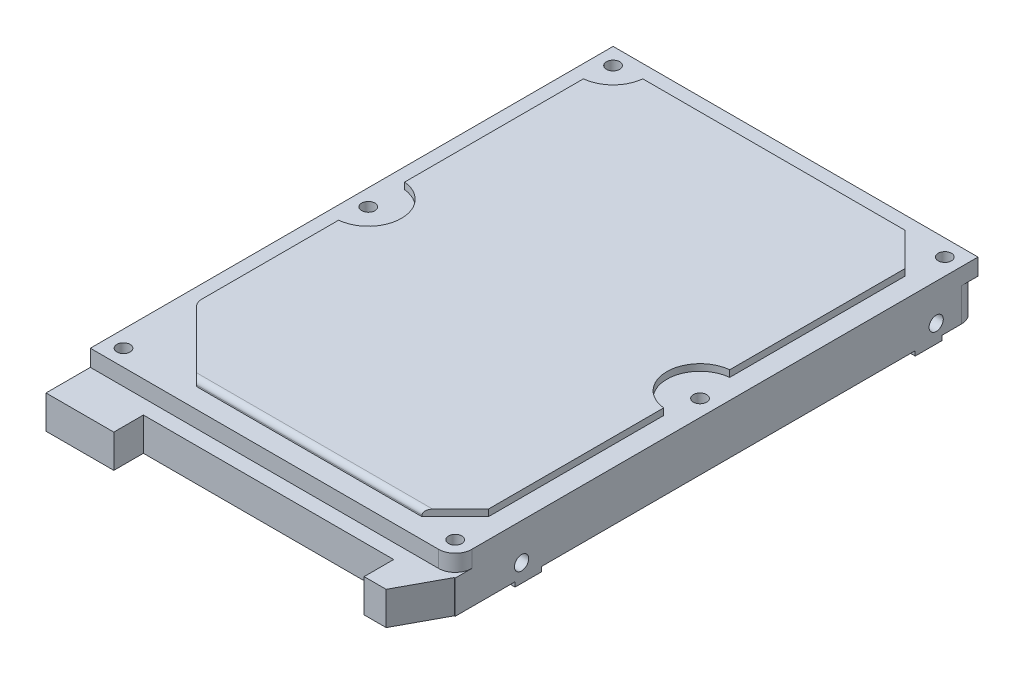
from build123d import *

# Parameters (mm, degrees)
S2D0001_W           = 69.85
S2D0001_H           = 100.076
BOSS_EXTRUDE1_DEPTH = 3.175
FILLET1_R           = 3.175
S2D0002_R           = 1.27
CUT_EXTRUDE1_DEPTH  = 3.4925
BOSS_EXTRUDE2_DEPTH = 1.27
FILLET2_R           = 2.54
FILLET3_R           = 1.016
BOSS_EXTRUDE3_DEPTH = 6.35
S2D0005_W           = 5.08
S2D0005_H           = 6.35
BOSS_EXTRUDE4_DEPTH = 69.85
BOSS_EXTRUDE5_DEPTH = 0.889
BOSS_EXTRUDE6_DEPTH = 6.35
SKETCH16_R          = 2
CUT_EXTRUDE2_DEPTH  = 2


with BuildPart() as part:
    # S2D0001 → Boss-Extrude1 (new body)
    with BuildSketch(Plane(origin=(0, 0, 0), x_dir=(1, 0, 0), z_dir=(0, 1, 0))):
        with Locations((34.925, 50.038)):
            Rectangle(S2D0001_W, S2D0001_H)
    extrude(amount=-BOSS_EXTRUDE1_DEPTH)

    # Fillet1
    fillet1_edges = [part.edges().sort_by_distance(p)[0] for p in [
        (69.85, -1.5875, 0),
    ]]
    fillet(fillet1_edges, radius=FILLET1_R)

    # S2D0002 → Cut-Extrude1 (cut)
    with BuildSketch(Plane(origin=(0, 0, 0), x_dir=(1, 0, 0), z_dir=(0, 1, 0))):
        with Locations(Location((3.175, 96.901, 0), (0, 0, 270))):
            Circle(S2D0002_R)
        with Locations(Location((66.675, 96.901, 0), (0, 0, 270))):
            Circle(S2D0002_R)
        with Locations(Location((3.175, 50.038, 0), (0, 0, 270))):
            Circle(S2D0002_R)
        with Locations(Location((66.675, 50.038, 0), (0, 0, 270))):
            Circle(S2D0002_R)
        with Locations(Location((3.175, 3.175, 0), (0, 0, 270))):
            Circle(S2D0002_R)
        with Locations(Location((66.675, 3.175, 0), (0, 0, 270))):
            Circle(S2D0002_R)
    extrude(amount=-CUT_EXTRUDE1_DEPTH, mode=Mode.SUBTRACT)

    # Sketch3 → Boss-Extrude2 (add)
    with BuildSketch(Plane(origin=(0, 0, 0), x_dir=(-1, 0, 0), z_dir=(0, 1, 0))):
        with BuildLine():
            Line((-9.493170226, -96.266), (-59.69, -96.266))
            Line((-59.69, -96.266), (-66.04, -89.916))
            Line((-66.04, -89.916), (-66.04, -56.356170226))
            ThreePointArc((-66.04, -56.356170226), (-60.325, -50.038), (-66.04, -43.719829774))
            Line((-66.04, -43.719829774), (-66.04, -10.16))
            Line((-66.04, -10.16), (-59.69, -3.81))
            Line((-59.69, -3.81), (-16.51, -3.81))
            Line((-16.51, -3.81), (-3.81, -16.51))
            Line((-3.81, -16.51), (-3.81, -43.719829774))
            ThreePointArc((-3.81, -43.719829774), (-9.525, -50.038), (-3.81, -56.356170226))
            Line((-3.81, -56.356170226), (-3.81, -90.582829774))
            ThreePointArc((-3.81, -90.582829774), (-7.665128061, -92.410871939), (-9.493170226, -96.266))
        make_face()
    extrude(amount=BOSS_EXTRUDE2_DEPTH)

    # Fillet2
    fillet2_edges = [part.edges().sort_by_distance(p)[0] for p in [
        (3.81, 0.635, -16.51),
    ]]
    fillet(fillet2_edges, radius=FILLET2_R)

    # Fillet3
    fillet3_edges = [part.edges().sort_by_distance(p)[0] for p in [
        (38.1, 1.27, -3.81),
    ]]
    fillet(fillet3_edges, radius=FILLET3_R)

    # Sketch4 → Boss-Extrude3 (add)
    with BuildSketch(Plane.XZ.offset(3.175)):
        with BuildLine():
            Line((0, -96.901), (0, 0))
            Line((0, 0), (69.85, 0))
            Line((69.85, 0), (69.85, -96.901))
            ThreePointArc((69.85, -96.901), (68.92006403, -99.14606403), (66.675, -100.076))
            Line((66.675, -100.076), (3.175, -100.076))
            ThreePointArc((3.175, -100.076), (0.92993597, -99.14606403), (0, -96.901))
        make_face()
    extrude(amount=BOSS_EXTRUDE3_DEPTH)

    # S2D0005 → Boss-Extrude4 (add)
    with BuildSketch(Plane(origin=(0, 0, 0), x_dir=(0, 0, -1), z_dir=(1, 0, 0))):
        with Locations((12.7, -6.35)):
            Rectangle(S2D0005_W, S2D0005_H)
        with Locations((92.075, -6.35)):
            Rectangle(S2D0005_W, S2D0005_H)
    extrude(amount=BOSS_EXTRUDE4_DEPTH)

    # S2D0007 → Cut-Revolve1 (revolve, cut)
    with BuildSketch(Plane(origin=(12.7, -5.6261, -92.075), x_dir=(0, 1, 0), z_dir=(0, 0, 1)), mode=Mode.PRIVATE) as cut_revolve1_sk:
        Polygon((-1.3589, 12.7), (-1.3589, -0.816509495), (0, 0), (0, 12.7), align=None)
    revolve(cut_revolve1_sk.sketch.rotate(Axis((14.19233497, -6.985, -92.075), (-1, 0, 0)), 270), axis=Axis((14.19233497, -6.985, -92.075), (-1, 0, 0)), mode=Mode.SUBTRACT)

    # Sketch7 → Cut-Revolve2 (revolve, cut)
    with BuildSketch(Plane(origin=(12.7, -5.6261, -12.7), x_dir=(0, 1, 0), z_dir=(0, 0, 1)), mode=Mode.PRIVATE) as cut_revolve2_sk:
        Polygon((-1.3589, 12.7), (-1.3589, -0.816509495), (0, 0), (0, 12.7), align=None)
    revolve(cut_revolve2_sk.sketch.rotate(Axis((14.19233497, -6.985, -12.7), (-1, 0, 0)), 270), axis=Axis((14.19233497, -6.985, -12.7), (-1, 0, 0)), mode=Mode.SUBTRACT)

    # S2D0008 → Cut-Revolve3 (revolve, cut)
    with BuildSketch(Plane(origin=(57.15, -8.3439, -12.7), x_dir=(0, -1, 0), z_dir=(0, 0, 1)), mode=Mode.PRIVATE) as cut_revolve3_sk:
        Polygon((-1.3589, 12.7), (-1.3589, -0.816509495), (0, 0), (0, 12.7), align=None)
    revolve(cut_revolve3_sk.sketch.rotate(Axis((55.65766503, -6.985, -12.7), (1, 0, 0)), 90), axis=Axis((55.65766503, -6.985, -12.7), (1, 0, 0)), mode=Mode.SUBTRACT)

    # S2D0009 → Cut-Revolve4 (revolve, cut)
    with BuildSketch(Plane(origin=(57.15, -8.3439, -92.075), x_dir=(0, -1, 0), z_dir=(0, 0, 1)), mode=Mode.PRIVATE) as cut_revolve4_sk:
        Polygon((-1.3589, 12.7), (-1.3589, -0.816509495), (0, 0), (0, 12.7), align=None)
    revolve(cut_revolve4_sk.sketch.rotate(Axis((55.65766503, -6.985, -92.075), (1, 0, 0)), 90), axis=Axis((55.65766503, -6.985, -92.075), (1, 0, 0)), mode=Mode.SUBTRACT)

    # Sketch10 → Boss-Extrude5 (add)
    with BuildSketch(Plane.XZ.offset(9.525)):
        with BuildLine():
            Line((0, -93.14), (0, -88.06))
            Line((0, -88.06), (4.065, -88.06))
            ThreePointArc((4.065, -88.06), (6.605, -90.6), (4.065, -93.14))
            Line((4.065, -93.14), (0, -93.14))
        make_face()
        with BuildLine():
            Line((0, -16.54), (0, -11.46))
            Line((0, -11.46), (4.065, -11.46))
            ThreePointArc((4.065, -11.46), (6.605, -14), (4.065, -16.54))
            Line((4.065, -16.54), (0, -16.54))
        make_face()
        with BuildLine():
            Line((69.85, -11.46), (69.85, -16.54))
            Line((69.85, -16.54), (65.785, -16.54))
            ThreePointArc((65.785, -16.54), (63.245, -14), (65.785, -11.46))
            Line((65.785, -11.46), (69.85, -11.46))
        make_face()
        with BuildLine():
            Line((69.85, -88.06), (69.85, -93.14))
            Line((69.85, -93.14), (65.785, -93.14))
            ThreePointArc((65.785, -93.14), (63.245, -90.6), (65.785, -88.06))
            Line((65.785, -88.06), (69.85, -88.06))
        make_face()
    extrude(amount=BOSS_EXTRUDE5_DEPTH)

    # Sketch15 → Boss-Extrude6 (add)
    with BuildSketch(Plane.XZ.offset(9.525)):
        Polygon((69.683605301, 0), (65.111605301, 8.4836), (60.895205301, 8.4836), (60.895205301, 2.8194), (12.9794, 2.8194), (12.9794, 8.4836), (0, 8.4836), (0, 0), align=None)
    extrude(amount=-BOSS_EXTRUDE6_DEPTH)

    # Sketch16 → Cut-Extrude2 (cut)
    with BuildSketch(Plane.XZ.offset(10.414)):
        with Locations(Location((4.065, -14, 0), (0, 0, 270))):
            Circle(SKETCH16_R)
        with Locations(Location((65.785, -14, 0), (0, 0, 270))):
            Circle(SKETCH16_R)
        with Locations(Location((65.785, -90.6, 0), (0, 0, 270))):
            Circle(SKETCH16_R)
        with Locations(Location((4.065, -90.6, 0), (0, 0, 270))):
            Circle(SKETCH16_R)
    extrude(amount=-CUT_EXTRUDE2_DEPTH, mode=Mode.SUBTRACT)


solid = part.part
